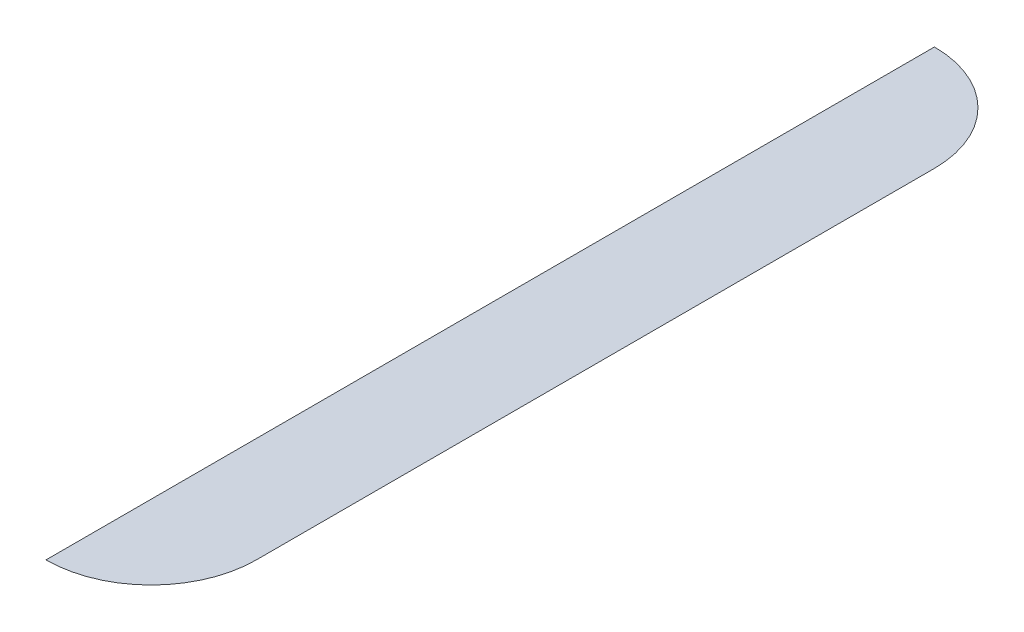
ISO-10303-21;
HEADER;
FILE_DESCRIPTION(('STEP AP214'),'2;1');
FILE_NAME('part.step','',(''),(''),'','','');
FILE_SCHEMA(('AUTOMOTIVE_DESIGN { 1 0 10303 214 1 1 1 1 }'));
ENDSEC;
DATA;
#1=APPLICATION_CONTEXT('core data for automotive mechanical design processes');
#2=APPLICATION_PROTOCOL_DEFINITION('international standard','automotive_design',2000,#1);
#3=PRODUCT_CONTEXT('',#1,'mechanical');
#4=PRODUCT('Part','Part','',(#3));
#5=PRODUCT_RELATED_PRODUCT_CATEGORY('part','',(#4));
#6=PRODUCT_DEFINITION_FORMATION('','',#4);
#7=PRODUCT_DEFINITION_CONTEXT('part definition',#1,'design');
#8=PRODUCT_DEFINITION('design','',#6,#7);
#9=PRODUCT_DEFINITION_SHAPE('','',#8);
#10=(LENGTH_UNIT() NAMED_UNIT(*) SI_UNIT(.MILLI.,.METRE.));
#11=(NAMED_UNIT(*) PLANE_ANGLE_UNIT() SI_UNIT($,.RADIAN.));
#12=(NAMED_UNIT(*) SI_UNIT($,.STERADIAN.) SOLID_ANGLE_UNIT());
#13=UNCERTAINTY_MEASURE_WITH_UNIT(LENGTH_MEASURE(1.E-05),#10,'distance_accuracy_value','');
#14=(GEOMETRIC_REPRESENTATION_CONTEXT(3) GLOBAL_UNCERTAINTY_ASSIGNED_CONTEXT((#13)) GLOBAL_UNIT_ASSIGNED_CONTEXT((#10,
#11,#12)) REPRESENTATION_CONTEXT('',''));
#15=CARTESIAN_POINT('',(0.,0.,0.));
#16=DIRECTION('',(0.,0.,1.));
#17=DIRECTION('',(1.,0.,0.));
#18=AXIS2_PLACEMENT_3D('',#15,#16,#17);
#19=CARTESIAN_POINT('',(-5.47370000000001,0.,12.7));
#20=DIRECTION('',(1.,0.,0.));
#21=DIRECTION('',(0.,0.,-1.));
#22=AXIS2_PLACEMENT_3D('',#19,#20,#21);
#23=PLANE('',#22);
#24=DIRECTION('',(0.,0.,-1.));
#25=VECTOR('',#24,1.);
#26=CARTESIAN_POINT('',(-5.47370000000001,0.,12.7));
#27=LINE('',#26,#25);
#28=CARTESIAN_POINT('',(-5.47370000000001,0.,49.9196273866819));
#29=VERTEX_POINT('',#28);
#30=CARTESIAN_POINT('',(-5.47370000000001,0.,-49.9196273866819));
#31=VERTEX_POINT('',#30);
#32=EDGE_CURVE('E109',#29,#31,#27,.T.);
#33=ORIENTED_EDGE('',*,*,#32,.T.);
#34=CARTESIAN_POINT('',(-5.47370000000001,-2.0574,-49.9196273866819));
#35=DIRECTION('',(1.,0.,0.));
#36=DIRECTION('',(0.,0.,-1.));
#37=AXIS2_PLACEMENT_3D('',#34,#35,#36);
#38=CIRCLE('',#37,2.0574);
#39=CARTESIAN_POINT('',(-5.47370000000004,-0.587965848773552,-48.4796072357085));
#40=VERTEX_POINT('',#39);
#41=EDGE_CURVE('E12',#31,#40,#38,.T.);
#42=ORIENTED_EDGE('',*,*,#41,.T.);
#43=CARTESIAN_POINT('',(-5.47370000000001,10.0036563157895,-38.1));
#44=DIRECTION('',(-1.,0.,0.));
#45=DIRECTION('',(0.,0.,1.));
#46=AXIS2_PLACEMENT_3D('',#43,#44,#45);
#47=CIRCLE('',#46,14.8296563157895);
#48=CARTESIAN_POINT('',(-5.47370000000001,-4.826,-38.1));
#49=VERTEX_POINT('',#48);
#50=EDGE_CURVE('E87',#40,#49,#47,.T.);
#51=ORIENTED_EDGE('',*,*,#50,.T.);
#52=DIRECTION('',(0.,0.,-1.));
#53=VECTOR('',#52,1.);
#54=CARTESIAN_POINT('',(-5.47370000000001,-4.826,12.7));
#55=LINE('',#54,#53);
#56=CARTESIAN_POINT('',(-5.47370000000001,-4.826,38.1));
#57=VERTEX_POINT('',#56);
#58=EDGE_CURVE('E91',#57,#49,#55,.T.);
#59=ORIENTED_EDGE('',*,*,#58,.F.);
#60=CARTESIAN_POINT('',(-5.47370000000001,10.0036563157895,38.1));
#61=DIRECTION('',(-1.,0.,0.));
#62=DIRECTION('',(0.,0.,1.));
#63=AXIS2_PLACEMENT_3D('',#60,#61,#62);
#64=CIRCLE('',#63,14.8296563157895);
#65=CARTESIAN_POINT('',(-5.47370000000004,-0.587965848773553,48.4796072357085));
#66=VERTEX_POINT('',#65);
#67=EDGE_CURVE('E95',#57,#66,#64,.T.);
#68=ORIENTED_EDGE('',*,*,#67,.T.);
#69=CARTESIAN_POINT('',(-5.47370000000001,-2.0574,49.9196273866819));
#70=DIRECTION('',(1.,0.,0.));
#71=DIRECTION('',(0.,0.,-1.));
#72=AXIS2_PLACEMENT_3D('',#69,#70,#71);
#73=CIRCLE('',#72,2.0574);
#74=EDGE_CURVE('E49',#66,#29,#73,.T.);
#75=ORIENTED_EDGE('',*,*,#74,.T.);
#76=EDGE_LOOP('',(#33,#42,#51,#59,#68,#75));
#77=FACE_BOUND('',#76,.T.);
#78=ADVANCED_FACE('F39',(#77),#23,.F.);
#79=CARTESIAN_POINT('',(-5.47370000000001,10.0036563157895,12.7));
#80=DIRECTION('',(0.,0.,-1.));
#81=DIRECTION('',(-1.,0.,0.));
#82=AXIS2_PLACEMENT_3D('',#79,#80,#81);
#83=CYLINDRICAL_SURFACE('',#82,14.8296563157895);
#84=CARTESIAN_POINT('',(-5.47370000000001,10.0036563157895,-38.1));
#85=DIRECTION('',(0.,0.,-1.));
#86=DIRECTION('',(-1.,0.,0.));
#87=AXIS2_PLACEMENT_3D('',#84,#85,#86);
#88=CIRCLE('',#87,14.8296563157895);
#89=CARTESIAN_POINT('',(4.90590723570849,-0.58796584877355,-38.1));
#90=VERTEX_POINT('',#89);
#91=EDGE_CURVE('E99',#90,#49,#88,.T.);
#92=ORIENTED_EDGE('',*,*,#91,.F.);
#93=DIRECTION('',(0.,0.,-1.));
#94=VECTOR('',#93,1.);
#95=CARTESIAN_POINT('',(4.90590723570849,-0.587965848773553,12.7));
#96=LINE('',#95,#94);
#97=CARTESIAN_POINT('',(4.90590723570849,-0.587965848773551,38.1));
#98=VERTEX_POINT('',#97);
#99=EDGE_CURVE('E116',#90,#98,#96,.F.);
#100=ORIENTED_EDGE('',*,*,#99,.T.);
#101=CARTESIAN_POINT('',(-5.47370000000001,10.0036563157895,38.1));
#102=DIRECTION('',(0.,0.,-1.));
#103=DIRECTION('',(-1.,0.,0.));
#104=AXIS2_PLACEMENT_3D('',#101,#102,#103);
#105=CIRCLE('',#104,14.8296563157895);
#106=EDGE_CURVE('E105',#98,#57,#105,.T.);
#107=ORIENTED_EDGE('',*,*,#106,.T.);
#108=ORIENTED_EDGE('',*,*,#58,.T.);
#109=EDGE_LOOP('',(#92,#100,#107,#108));
#110=FACE_BOUND('',#109,.T.);
#111=ADVANCED_FACE('F107',(#110),#83,.T.);
#112=CARTESIAN_POINT('',(-5.47370000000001,10.0036563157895,38.1));
#113=DIRECTION('',(0.,1.,0.));
#114=DIRECTION('',(0.,0.,-1.));
#115=AXIS2_PLACEMENT_3D('',#112,#113,#114);
#116=SPHERICAL_SURFACE('',#115,14.8296563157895);
#117=ORIENTED_EDGE('',*,*,#106,.F.);
#118=CARTESIAN_POINT('',(-5.47370000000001,-0.58796584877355,38.1));
#119=DIRECTION('',(0.,1.,0.));
#120=DIRECTION('',(0.,0.,1.));
#121=AXIS2_PLACEMENT_3D('',#118,#119,#120);
#122=CIRCLE('',#121,10.3796072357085);
#123=EDGE_CURVE('E118',#98,#66,#122,.F.);
#124=ORIENTED_EDGE('',*,*,#123,.T.);
#125=ORIENTED_EDGE('',*,*,#67,.F.);
#126=EDGE_LOOP('',(#117,#124,#125));
#127=FACE_BOUND('',#126,.T.);
#128=ADVANCED_FACE('F147',(#127),#116,.T.);
#129=CARTESIAN_POINT('',(-5.47370000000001,10.0036563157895,-38.1));
#130=DIRECTION('',(0.,-1.,0.));
#131=DIRECTION('',(0.,0.,-1.));
#132=AXIS2_PLACEMENT_3D('',#129,#130,#131);
#133=SPHERICAL_SURFACE('',#132,14.8296563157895);
#134=ORIENTED_EDGE('',*,*,#50,.F.);
#135=CARTESIAN_POINT('',(-5.47370000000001,-0.587965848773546,-38.1));
#136=DIRECTION('',(0.,1.,0.));
#137=DIRECTION('',(0.,0.,1.));
#138=AXIS2_PLACEMENT_3D('',#135,#136,#137);
#139=CIRCLE('',#138,10.3796072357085);
#140=EDGE_CURVE('E101',#40,#90,#139,.F.);
#141=ORIENTED_EDGE('',*,*,#140,.T.);
#142=ORIENTED_EDGE('',*,*,#91,.T.);
#143=EDGE_LOOP('',(#134,#141,#142));
#144=FACE_BOUND('',#143,.T.);
#145=ADVANCED_FACE('F100',(#144),#133,.T.);
#146=CARTESIAN_POINT('',(-5.47370000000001,-2.0574,-38.1));
#147=DIRECTION('',(0.,1.,0.));
#148=DIRECTION('',(0.,0.,1.));
#149=AXIS2_PLACEMENT_3D('',#146,#147,#148);
#150=TOROIDAL_SURFACE('',#149,11.8196273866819,2.0574);
#151=ORIENTED_EDGE('',*,*,#41,.F.);
#152=CARTESIAN_POINT('',(-5.47370000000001,0.,-38.1));
#153=DIRECTION('',(0.,1.,0.));
#154=DIRECTION('',(0.,0.,1.));
#155=AXIS2_PLACEMENT_3D('',#152,#153,#154);
#156=CIRCLE('',#155,11.8196273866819);
#157=CARTESIAN_POINT('',(6.34592738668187,0.,-38.1));
#158=VERTEX_POINT('',#157);
#159=EDGE_CURVE('E111',#158,#31,#156,.T.);
#160=ORIENTED_EDGE('',*,*,#159,.F.);
#161=CARTESIAN_POINT('',(6.34592738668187,-2.0574,-38.1));
#162=DIRECTION('',(0.,0.,-1.));
#163=DIRECTION('',(-1.,0.,0.));
#164=AXIS2_PLACEMENT_3D('',#161,#162,#163);
#165=CIRCLE('',#164,2.0574);
#166=EDGE_CURVE('E96',#90,#158,#165,.T.);
#167=ORIENTED_EDGE('',*,*,#166,.F.);
#168=ORIENTED_EDGE('',*,*,#140,.F.);
#169=EDGE_LOOP('',(#151,#160,#167,#168));
#170=FACE_BOUND('',#169,.T.);
#171=ADVANCED_FACE('F134',(#170),#150,.F.);
#172=CARTESIAN_POINT('',(6.34592738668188,-2.0574,12.7));
#173=DIRECTION('',(0.,0.,-1.));
#174=DIRECTION('',(-1.,0.,0.));
#175=AXIS2_PLACEMENT_3D('',#172,#173,#174);
#176=CYLINDRICAL_SURFACE('',#175,2.0574);
#177=ORIENTED_EDGE('',*,*,#166,.T.);
#178=DIRECTION('',(0.,0.,-1.));
#179=VECTOR('',#178,1.);
#180=CARTESIAN_POINT('',(6.34592738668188,0.,38.1));
#181=LINE('',#180,#179);
#182=CARTESIAN_POINT('',(6.34592738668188,0.,38.1));
#183=VERTEX_POINT('',#182);
#184=EDGE_CURVE('E83',#183,#158,#181,.T.);
#185=ORIENTED_EDGE('',*,*,#184,.F.);
#186=CARTESIAN_POINT('',(6.34592738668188,-2.0574,38.1));
#187=DIRECTION('',(0.,0.,-1.));
#188=DIRECTION('',(-1.,0.,0.));
#189=AXIS2_PLACEMENT_3D('',#186,#187,#188);
#190=CIRCLE('',#189,2.0574);
#191=EDGE_CURVE('E43',#98,#183,#190,.T.);
#192=ORIENTED_EDGE('',*,*,#191,.F.);
#193=ORIENTED_EDGE('',*,*,#99,.F.);
#194=EDGE_LOOP('',(#177,#185,#192,#193));
#195=FACE_BOUND('',#194,.T.);
#196=ADVANCED_FACE('F132',(#195),#176,.F.);
#197=CARTESIAN_POINT('',(-5.47370000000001,-2.0574,38.1));
#198=DIRECTION('',(0.,1.,0.));
#199=DIRECTION('',(0.,0.,1.));
#200=AXIS2_PLACEMENT_3D('',#197,#198,#199);
#201=TOROIDAL_SURFACE('',#200,11.8196273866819,2.0574);
#202=ORIENTED_EDGE('',*,*,#74,.F.);
#203=ORIENTED_EDGE('',*,*,#123,.F.);
#204=ORIENTED_EDGE('',*,*,#191,.T.);
#205=CARTESIAN_POINT('',(-5.47370000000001,0.,38.1));
#206=DIRECTION('',(0.,1.,0.));
#207=DIRECTION('',(0.,0.,1.));
#208=AXIS2_PLACEMENT_3D('',#205,#206,#207);
#209=CIRCLE('',#208,11.8196273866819);
#210=EDGE_CURVE('E79',#29,#183,#209,.T.);
#211=ORIENTED_EDGE('',*,*,#210,.F.);
#212=EDGE_LOOP('',(#202,#203,#204,#211));
#213=FACE_BOUND('',#212,.T.);
#214=ADVANCED_FACE('F41',(#213),#201,.F.);
#215=CARTESIAN_POINT('',(15.,0.,-38.1));
#216=DIRECTION('',(0.,-1.,0.));
#217=DIRECTION('',(0.,0.,-1.));
#218=AXIS2_PLACEMENT_3D('',#215,#216,#217);
#219=PLANE('',#218);
#220=ORIENTED_EDGE('',*,*,#210,.T.);
#221=ORIENTED_EDGE('',*,*,#184,.T.);
#222=ORIENTED_EDGE('',*,*,#159,.T.);
#223=ORIENTED_EDGE('',*,*,#32,.F.);
#224=EDGE_LOOP('',(#220,#221,#222,#223));
#225=FACE_BOUND('',#224,.T.);
#226=ADVANCED_FACE('F135',(#225),#219,.F.);
#227=CLOSED_SHELL('',(#78,#111,#128,#145,#171,#196,#214,#226));
#228=MANIFOLD_SOLID_BREP('B2',#227);
#229=ADVANCED_BREP_SHAPE_REPRESENTATION('',(#18,#228),#14);
#230=SHAPE_DEFINITION_REPRESENTATION(#9,#229);
ENDSEC;
END-ISO-10303-21;
